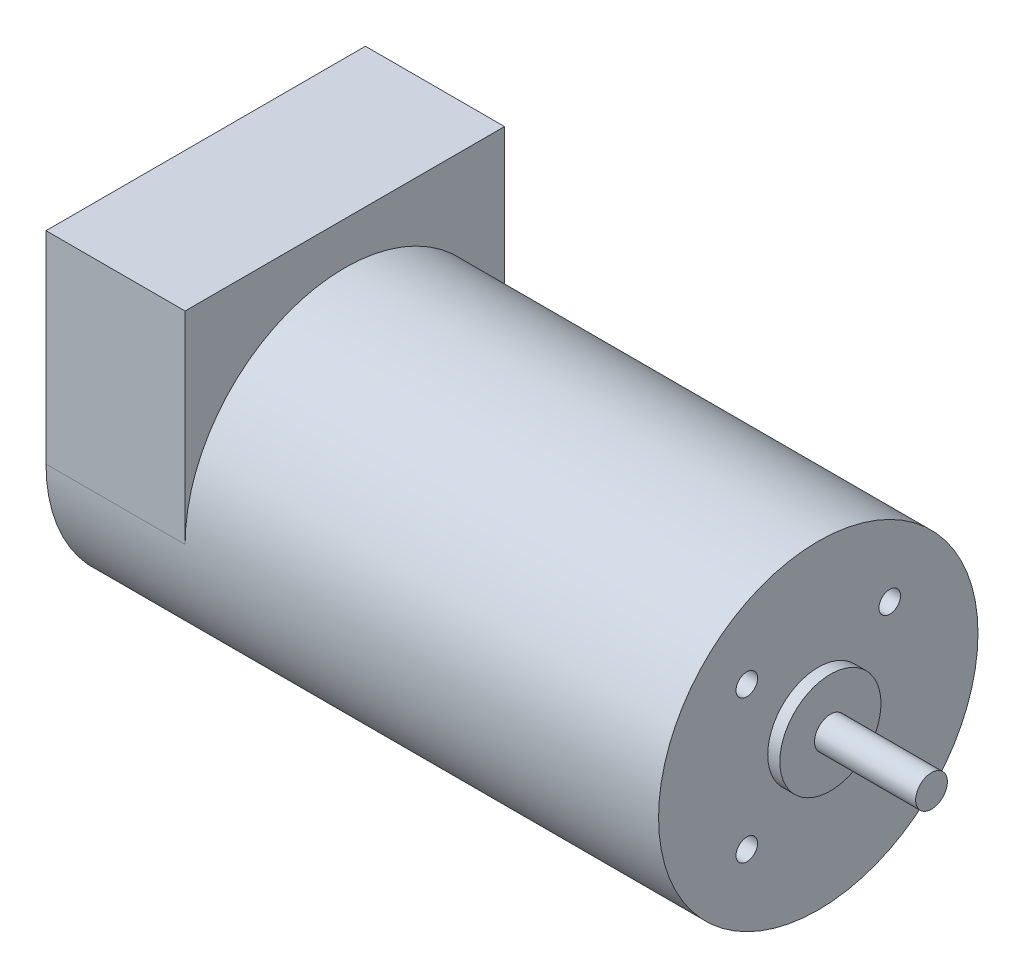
ISO-10303-21;
HEADER;
FILE_DESCRIPTION(('STEP AP214'),'2;1');
FILE_NAME('part.step','',(''),(''),'','','');
FILE_SCHEMA(('AUTOMOTIVE_DESIGN { 1 0 10303 214 1 1 1 1 }'));
ENDSEC;
DATA;
#1=APPLICATION_CONTEXT('core data for automotive mechanical design processes');
#2=APPLICATION_PROTOCOL_DEFINITION('international standard','automotive_design',2000,#1);
#3=PRODUCT_CONTEXT('',#1,'mechanical');
#4=PRODUCT('Part','Part','',(#3));
#5=PRODUCT_RELATED_PRODUCT_CATEGORY('part','',(#4));
#6=PRODUCT_DEFINITION_FORMATION('','',#4);
#7=PRODUCT_DEFINITION_CONTEXT('part definition',#1,'design');
#8=PRODUCT_DEFINITION('design','',#6,#7);
#9=PRODUCT_DEFINITION_SHAPE('','',#8);
#10=(LENGTH_UNIT() NAMED_UNIT(*) SI_UNIT(.MILLI.,.METRE.));
#11=(NAMED_UNIT(*) PLANE_ANGLE_UNIT() SI_UNIT($,.RADIAN.));
#12=(NAMED_UNIT(*) SI_UNIT($,.STERADIAN.) SOLID_ANGLE_UNIT());
#13=UNCERTAINTY_MEASURE_WITH_UNIT(LENGTH_MEASURE(1.E-05),#10,'distance_accuracy_value','');
#14=(GEOMETRIC_REPRESENTATION_CONTEXT(3) GLOBAL_UNCERTAINTY_ASSIGNED_CONTEXT((#13)) GLOBAL_UNIT_ASSIGNED_CONTEXT((#10,
#11,#12)) REPRESENTATION_CONTEXT('',''));
#15=CARTESIAN_POINT('',(0.,0.,0.));
#16=DIRECTION('',(0.,0.,1.));
#17=DIRECTION('',(1.,0.,0.));
#18=AXIS2_PLACEMENT_3D('',#15,#16,#17);
#19=CARTESIAN_POINT('',(78.486,0.,0.));
#20=DIRECTION('',(1.,0.,0.));
#21=DIRECTION('',(0.,0.,-1.));
#22=AXIS2_PLACEMENT_3D('',#19,#20,#21);
#23=PLANE('',#22);
#24=CARTESIAN_POINT('',(78.486,0.,0.));
#25=DIRECTION('',(1.,0.,0.));
#26=DIRECTION('',(0.,0.,-1.));
#27=AXIS2_PLACEMENT_3D('',#24,#25,#26);
#28=CIRCLE('',#27,6.35);
#29=CARTESIAN_POINT('',(78.486,0.,6.35));
#30=VERTEX_POINT('',#29);
#31=EDGE_CURVE('E139',#30,#30,#28,.T.);
#32=ORIENTED_EDGE('',*,*,#31,.T.);
#33=EDGE_LOOP('',(#32));
#34=FACE_BOUND('',#33,.T.);
#35=CARTESIAN_POINT('',(78.486,0.,0.));
#36=DIRECTION('',(1.,0.,0.));
#37=DIRECTION('',(0.,0.,-1.));
#38=AXIS2_PLACEMENT_3D('',#35,#36,#37);
#39=CIRCLE('',#38,1.9939);
#40=CARTESIAN_POINT('',(78.486,0.,-1.9939));
#41=VERTEX_POINT('',#40);
#42=EDGE_CURVE('E132',#41,#41,#39,.T.);
#43=ORIENTED_EDGE('',*,*,#42,.F.);
#44=EDGE_LOOP('',(#43));
#45=FACE_BOUND('',#44,.T.);
#46=ADVANCED_FACE('F36',(#34,#45),#23,.T.);
#47=CARTESIAN_POINT('',(76.962,0.,0.));
#48=DIRECTION('',(1.,0.,0.));
#49=DIRECTION('',(0.,0.,-1.));
#50=AXIS2_PLACEMENT_3D('',#47,#48,#49);
#51=PLANE('',#50);
#52=CARTESIAN_POINT('',(76.962,8.98025612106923,-8.98025612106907));
#53=DIRECTION('',(1.,0.,0.));
#54=DIRECTION('',(0.,0.,-1.));
#55=AXIS2_PLACEMENT_3D('',#52,#53,#54);
#56=CIRCLE('',#55,1.35255);
#57=CARTESIAN_POINT('',(76.962,8.98025612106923,-10.3328061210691));
#58=VERTEX_POINT('',#57);
#59=EDGE_CURVE('E110',#58,#58,#56,.T.);
#60=ORIENTED_EDGE('',*,*,#59,.F.);
#61=EDGE_LOOP('',(#60));
#62=FACE_BOUND('',#61,.T.);
#63=CARTESIAN_POINT('',(76.962,-8.98025612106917,-8.98025612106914));
#64=DIRECTION('',(1.,0.,0.));
#65=DIRECTION('',(0.,0.,-1.));
#66=AXIS2_PLACEMENT_3D('',#63,#64,#65);
#67=CIRCLE('',#66,1.35255);
#68=CARTESIAN_POINT('',(76.962,-8.98025612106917,-10.3328061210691));
#69=VERTEX_POINT('',#68);
#70=EDGE_CURVE('E109',#69,#69,#67,.T.);
#71=ORIENTED_EDGE('',*,*,#70,.F.);
#72=EDGE_LOOP('',(#71));
#73=FACE_BOUND('',#72,.T.);
#74=CARTESIAN_POINT('',(76.962,-8.98025612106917,8.98025612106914));
#75=DIRECTION('',(1.,0.,0.));
#76=DIRECTION('',(0.,0.,-1.));
#77=AXIS2_PLACEMENT_3D('',#74,#75,#76);
#78=CIRCLE('',#77,1.35255);
#79=CARTESIAN_POINT('',(76.962,-8.98025612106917,7.62770612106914));
#80=VERTEX_POINT('',#79);
#81=EDGE_CURVE('E120',#80,#80,#78,.T.);
#82=ORIENTED_EDGE('',*,*,#81,.F.);
#83=EDGE_LOOP('',(#82));
#84=FACE_BOUND('',#83,.T.);
#85=CARTESIAN_POINT('',(76.962,8.98025612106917,8.98025612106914));
#86=DIRECTION('',(1.,0.,0.));
#87=DIRECTION('',(0.,0.,-1.));
#88=AXIS2_PLACEMENT_3D('',#85,#86,#87);
#89=CIRCLE('',#88,1.35255);
#90=CARTESIAN_POINT('',(76.962,8.98025612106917,7.62770612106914));
#91=VERTEX_POINT('',#90);
#92=EDGE_CURVE('E126',#91,#91,#89,.T.);
#93=ORIENTED_EDGE('',*,*,#92,.F.);
#94=EDGE_LOOP('',(#93));
#95=FACE_BOUND('',#94,.T.);
#96=CARTESIAN_POINT('',(76.962,0.,0.));
#97=DIRECTION('',(1.,0.,0.));
#98=DIRECTION('',(0.,0.,-1.));
#99=AXIS2_PLACEMENT_3D('',#96,#97,#98);
#100=CIRCLE('',#99,20.066);
#101=CARTESIAN_POINT('',(76.962,0.,-20.066));
#102=VERTEX_POINT('',#101);
#103=EDGE_CURVE('E145',#102,#102,#100,.T.);
#104=ORIENTED_EDGE('',*,*,#103,.T.);
#105=EDGE_LOOP('',(#104));
#106=FACE_BOUND('',#105,.T.);
#107=CARTESIAN_POINT('',(76.962,0.,0.));
#108=DIRECTION('',(1.,0.,0.));
#109=DIRECTION('',(0.,0.,-1.));
#110=AXIS2_PLACEMENT_3D('',#107,#108,#109);
#111=CIRCLE('',#110,6.35);
#112=CARTESIAN_POINT('',(76.962,0.,6.35));
#113=VERTEX_POINT('',#112);
#114=EDGE_CURVE('E136',#113,#113,#111,.T.);
#115=ORIENTED_EDGE('',*,*,#114,.F.);
#116=EDGE_LOOP('',(#115));
#117=FACE_BOUND('',#116,.T.);
#118=ADVANCED_FACE('F182',(#62,#73,#84,#95,#106,#117),#51,.T.);
#119=CARTESIAN_POINT('',(17.4752,0.,0.));
#120=DIRECTION('',(-1.,0.,0.));
#121=DIRECTION('',(0.,0.,1.));
#122=AXIS2_PLACEMENT_3D('',#119,#120,#121);
#123=PLANE('',#122);
#124=CARTESIAN_POINT('',(17.4752,0.,0.));
#125=DIRECTION('',(1.,0.,0.));
#126=DIRECTION('',(0.,0.,-1.));
#127=AXIS2_PLACEMENT_3D('',#124,#125,#126);
#128=CIRCLE('',#127,20.066);
#129=CARTESIAN_POINT('',(17.4752,0.,-20.066));
#130=VERTEX_POINT('',#129);
#131=CARTESIAN_POINT('',(17.4752,0.,20.066));
#132=VERTEX_POINT('',#131);
#133=EDGE_CURVE('E142',#130,#132,#128,.T.);
#134=ORIENTED_EDGE('',*,*,#133,.F.);
#135=DIRECTION('',(0.,1.,0.));
#136=VECTOR('',#135,1.);
#137=CARTESIAN_POINT('',(17.4752,0.,-20.066));
#138=LINE('',#137,#136);
#139=CARTESIAN_POINT('',(17.4752,25.4,-20.066));
#140=VERTEX_POINT('',#139);
#141=EDGE_CURVE('E82',#130,#140,#138,.T.);
#142=ORIENTED_EDGE('',*,*,#141,.T.);
#143=DIRECTION('',(0.,0.,1.));
#144=VECTOR('',#143,1.);
#145=CARTESIAN_POINT('',(17.4752,25.4,-20.066));
#146=LINE('',#145,#144);
#147=CARTESIAN_POINT('',(17.4752,25.4,20.066));
#148=VERTEX_POINT('',#147);
#149=EDGE_CURVE('E152',#140,#148,#146,.T.);
#150=ORIENTED_EDGE('',*,*,#149,.T.);
#151=DIRECTION('',(0.,-1.,0.));
#152=VECTOR('',#151,1.);
#153=CARTESIAN_POINT('',(17.4752,25.4,20.066));
#154=LINE('',#153,#152);
#155=EDGE_CURVE('E55',#148,#132,#154,.T.);
#156=ORIENTED_EDGE('',*,*,#155,.T.);
#157=EDGE_LOOP('',(#134,#142,#150,#156));
#158=FACE_BOUND('',#157,.T.);
#159=ADVANCED_FACE('F180',(#158),#123,.F.);
#160=CARTESIAN_POINT('',(17.4752,0.,0.));
#161=DIRECTION('',(-1.,0.,0.));
#162=DIRECTION('',(0.,0.,1.));
#163=AXIS2_PLACEMENT_3D('',#160,#161,#162);
#164=CYLINDRICAL_SURFACE('',#163,20.066);
#165=CARTESIAN_POINT('',(0.,0.,0.));
#166=DIRECTION('',(1.,0.,0.));
#167=DIRECTION('',(0.,0.,1.));
#168=AXIS2_PLACEMENT_3D('',#165,#166,#167);
#169=CIRCLE('',#168,20.066);
#170=CARTESIAN_POINT('',(0.,0.,20.066));
#171=VERTEX_POINT('',#170);
#172=CARTESIAN_POINT('',(0.,0.,-20.066));
#173=VERTEX_POINT('',#172);
#174=EDGE_CURVE('E148',#171,#173,#169,.T.);
#175=ORIENTED_EDGE('',*,*,#174,.T.);
#176=DIRECTION('',(-1.,0.,0.));
#177=VECTOR('',#176,1.);
#178=CARTESIAN_POINT('',(17.4752,0.,-20.066));
#179=LINE('',#178,#177);
#180=EDGE_CURVE('E11',#130,#173,#179,.T.);
#181=ORIENTED_EDGE('',*,*,#180,.F.);
#182=ORIENTED_EDGE('',*,*,#133,.T.);
#183=DIRECTION('',(-1.,0.,0.));
#184=VECTOR('',#183,1.);
#185=CARTESIAN_POINT('',(17.4752,0.,20.066));
#186=LINE('',#185,#184);
#187=EDGE_CURVE('E164',#132,#171,#186,.T.);
#188=ORIENTED_EDGE('',*,*,#187,.T.);
#189=EDGE_LOOP('',(#175,#181,#182,#188));
#190=FACE_BOUND('',#189,.T.);
#191=ORIENTED_EDGE('',*,*,#103,.F.);
#192=EDGE_LOOP('',(#191));
#193=FACE_BOUND('',#192,.T.);
#194=ADVANCED_FACE('F38',(#190,#193),#164,.T.);
#195=CARTESIAN_POINT('',(17.4752,0.,-20.066));
#196=DIRECTION('',(0.,0.,1.));
#197=DIRECTION('',(1.,0.,0.));
#198=AXIS2_PLACEMENT_3D('',#195,#196,#197);
#199=PLANE('',#198);
#200=DIRECTION('',(0.,1.,0.));
#201=VECTOR('',#200,1.);
#202=CARTESIAN_POINT('',(0.,0.,-20.066));
#203=LINE('',#202,#201);
#204=CARTESIAN_POINT('',(0.,25.4,-20.066));
#205=VERTEX_POINT('',#204);
#206=EDGE_CURVE('E173',#173,#205,#203,.T.);
#207=ORIENTED_EDGE('',*,*,#206,.T.);
#208=DIRECTION('',(-1.,0.,0.));
#209=VECTOR('',#208,1.);
#210=CARTESIAN_POINT('',(17.4752,25.4,-20.066));
#211=LINE('',#210,#209);
#212=EDGE_CURVE('E46',#140,#205,#211,.T.);
#213=ORIENTED_EDGE('',*,*,#212,.F.);
#214=ORIENTED_EDGE('',*,*,#141,.F.);
#215=ORIENTED_EDGE('',*,*,#180,.T.);
#216=EDGE_LOOP('',(#207,#213,#214,#215));
#217=FACE_BOUND('',#216,.T.);
#218=ADVANCED_FACE('F178',(#217),#199,.F.);
#219=CARTESIAN_POINT('',(17.4752,25.4,-20.066));
#220=DIRECTION('',(0.,-1.,0.));
#221=DIRECTION('',(0.,0.,-1.));
#222=AXIS2_PLACEMENT_3D('',#219,#220,#221);
#223=PLANE('',#222);
#224=DIRECTION('',(0.,0.,1.));
#225=VECTOR('',#224,1.);
#226=CARTESIAN_POINT('',(0.,25.4,-20.066));
#227=LINE('',#226,#225);
#228=CARTESIAN_POINT('',(0.,25.4,20.066));
#229=VERTEX_POINT('',#228);
#230=EDGE_CURVE('E73',#205,#229,#227,.T.);
#231=ORIENTED_EDGE('',*,*,#230,.T.);
#232=DIRECTION('',(-1.,0.,0.));
#233=VECTOR('',#232,1.);
#234=CARTESIAN_POINT('',(17.4752,25.4,20.066));
#235=LINE('',#234,#233);
#236=EDGE_CURVE('E166',#148,#229,#235,.T.);
#237=ORIENTED_EDGE('',*,*,#236,.F.);
#238=ORIENTED_EDGE('',*,*,#149,.F.);
#239=ORIENTED_EDGE('',*,*,#212,.T.);
#240=EDGE_LOOP('',(#231,#237,#238,#239));
#241=FACE_BOUND('',#240,.T.);
#242=ADVANCED_FACE('F218',(#241),#223,.F.);
#243=CARTESIAN_POINT('',(17.4752,25.4,20.066));
#244=DIRECTION('',(0.,0.,-1.));
#245=DIRECTION('',(0.,1.,0.));
#246=AXIS2_PLACEMENT_3D('',#243,#244,#245);
#247=PLANE('',#246);
#248=DIRECTION('',(0.,-1.,0.));
#249=VECTOR('',#248,1.);
#250=CARTESIAN_POINT('',(0.,25.4,20.066));
#251=LINE('',#250,#249);
#252=EDGE_CURVE('E78',#229,#171,#251,.T.);
#253=ORIENTED_EDGE('',*,*,#252,.T.);
#254=ORIENTED_EDGE('',*,*,#187,.F.);
#255=ORIENTED_EDGE('',*,*,#155,.F.);
#256=ORIENTED_EDGE('',*,*,#236,.T.);
#257=EDGE_LOOP('',(#253,#254,#255,#256));
#258=FACE_BOUND('',#257,.T.);
#259=ADVANCED_FACE('F210',(#258),#247,.F.);
#260=CARTESIAN_POINT('',(0.,0.,0.));
#261=DIRECTION('',(-1.,0.,0.));
#262=DIRECTION('',(0.,0.,1.));
#263=AXIS2_PLACEMENT_3D('',#260,#261,#262);
#264=PLANE('',#263);
#265=ORIENTED_EDGE('',*,*,#174,.F.);
#266=ORIENTED_EDGE('',*,*,#252,.F.);
#267=ORIENTED_EDGE('',*,*,#230,.F.);
#268=ORIENTED_EDGE('',*,*,#206,.F.);
#269=EDGE_LOOP('',(#265,#266,#267,#268));
#270=FACE_BOUND('',#269,.T.);
#271=ADVANCED_FACE('F176',(#270),#264,.T.);
#272=CARTESIAN_POINT('',(78.486,0.,0.));
#273=DIRECTION('',(-1.,0.,0.));
#274=DIRECTION('',(0.,0.,1.));
#275=AXIS2_PLACEMENT_3D('',#272,#273,#274);
#276=CYLINDRICAL_SURFACE('',#275,6.35);
#277=CARTESIAN_POINT('',(78.486,0.,6.35));
#278=CARTESIAN_POINT('',(78.470125,0.,6.35));
#279=CARTESIAN_POINT('',(78.45425,0.,6.35));
#280=CARTESIAN_POINT('',(78.4225,0.,6.35));
#281=CARTESIAN_POINT('',(78.406625,0.,6.35));
#282=CARTESIAN_POINT('',(78.374875,0.,6.35));
#283=CARTESIAN_POINT('',(78.359,0.,6.35));
#284=CARTESIAN_POINT('',(78.32725,0.,6.35));
#285=CARTESIAN_POINT('',(78.311375,0.,6.35));
#286=CARTESIAN_POINT('',(78.279625,0.,6.35));
#287=CARTESIAN_POINT('',(78.26375,0.,6.35));
#288=CARTESIAN_POINT('',(78.232,0.,6.35));
#289=CARTESIAN_POINT('',(78.216125,0.,6.35));
#290=CARTESIAN_POINT('',(78.184375,0.,6.35));
#291=CARTESIAN_POINT('',(78.1685,0.,6.35));
#292=CARTESIAN_POINT('',(78.13675,0.,6.35));
#293=CARTESIAN_POINT('',(78.120875,0.,6.35));
#294=CARTESIAN_POINT('',(78.089125,0.,6.35));
#295=CARTESIAN_POINT('',(78.07325,0.,6.35));
#296=CARTESIAN_POINT('',(78.0415,0.,6.35));
#297=CARTESIAN_POINT('',(78.025625,0.,6.35));
#298=CARTESIAN_POINT('',(77.993875,0.,6.35));
#299=CARTESIAN_POINT('',(77.978,0.,6.35));
#300=CARTESIAN_POINT('',(77.94625,0.,6.35));
#301=CARTESIAN_POINT('',(77.930375,0.,6.35));
#302=CARTESIAN_POINT('',(77.898625,0.,6.35));
#303=CARTESIAN_POINT('',(77.88275,0.,6.35));
#304=CARTESIAN_POINT('',(77.851,0.,6.35));
#305=CARTESIAN_POINT('',(77.835125,0.,6.35));
#306=CARTESIAN_POINT('',(77.803375,0.,6.35));
#307=CARTESIAN_POINT('',(77.7875,0.,6.35));
#308=CARTESIAN_POINT('',(77.75575,0.,6.35));
#309=CARTESIAN_POINT('',(77.739875,0.,6.35));
#310=CARTESIAN_POINT('',(77.708125,0.,6.35));
#311=CARTESIAN_POINT('',(77.69225,0.,6.35));
#312=CARTESIAN_POINT('',(77.6605,0.,6.35));
#313=CARTESIAN_POINT('',(77.644625,0.,6.35));
#314=CARTESIAN_POINT('',(77.612875,0.,6.35));
#315=CARTESIAN_POINT('',(77.597,0.,6.35));
#316=CARTESIAN_POINT('',(77.56525,0.,6.35));
#317=CARTESIAN_POINT('',(77.549375,0.,6.35));
#318=CARTESIAN_POINT('',(77.517625,0.,6.35));
#319=CARTESIAN_POINT('',(77.50175,0.,6.35));
#320=CARTESIAN_POINT('',(77.47,0.,6.35));
#321=CARTESIAN_POINT('',(77.454125,0.,6.35));
#322=CARTESIAN_POINT('',(77.422375,0.,6.35));
#323=CARTESIAN_POINT('',(77.4065,0.,6.35));
#324=CARTESIAN_POINT('',(77.37475,0.,6.35));
#325=CARTESIAN_POINT('',(77.358875,0.,6.35));
#326=CARTESIAN_POINT('',(77.327125,0.,6.35));
#327=CARTESIAN_POINT('',(77.31125,0.,6.35));
#328=CARTESIAN_POINT('',(77.2795,0.,6.35));
#329=CARTESIAN_POINT('',(77.263625,0.,6.35));
#330=CARTESIAN_POINT('',(77.231875,0.,6.35));
#331=CARTESIAN_POINT('',(77.216,0.,6.35));
#332=CARTESIAN_POINT('',(77.18425,0.,6.35));
#333=CARTESIAN_POINT('',(77.168375,0.,6.35));
#334=CARTESIAN_POINT('',(77.136625,0.,6.35));
#335=CARTESIAN_POINT('',(77.12075,0.,6.35));
#336=CARTESIAN_POINT('',(77.089,0.,6.35));
#337=CARTESIAN_POINT('',(77.073125,0.,6.35));
#338=CARTESIAN_POINT('',(77.041375,0.,6.35));
#339=CARTESIAN_POINT('',(77.0255,0.,6.35));
#340=CARTESIAN_POINT('',(76.99375,0.,6.35));
#341=CARTESIAN_POINT('',(76.977875,0.,6.35));
#342=CARTESIAN_POINT('',(76.962,0.,6.35));
#343=B_SPLINE_CURVE_WITH_KNOTS('',3,(#277,#278,#279,#280,#281,#282,#283,#284,#285,#286,#287,
#288,#289,#290,#291,#292,#293,#294,#295,#296,#297,#298,#299,#300,#301,#302,#303,#304,#305,#306,
#307,#308,#309,#310,#311,#312,#313,#314,#315,#316,#317,#318,#319,#320,#321,#322,#323,#324,#325,
#326,#327,#328,#329,#330,#331,#332,#333,#334,#335,#336,#337,#338,#339,#340,#341,#342),
.UNSPECIFIED.,.F.,.F.,(4,2,2,2,2,2,2,2,2,2,2,2,2,2,2,2,2,2,2,2,2,2,2,2,2,2,2,2,2,2,2,2,4),(0.,
0.0476249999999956,0.0952499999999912,0.142874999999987,0.190499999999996,0.238124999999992,
0.285749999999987,0.333374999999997,0.380999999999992,0.428624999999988,0.476249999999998,
0.523874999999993,0.571499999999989,0.619124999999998,0.666749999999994,0.714374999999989,
0.761999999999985,0.809624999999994,0.85724999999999,0.904874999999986,0.952499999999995,
1.00012499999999,1.04774999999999,1.095375,1.14299999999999,1.19062499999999,1.23825,
1.28587499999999,1.33349999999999,1.381125,1.42874999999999,1.47637499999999,1.52399999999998),.UNSPECIFIED.);
#344=EDGE_CURVE('BSEAM201',#30,#113,#343,.T.);
#345=ORIENTED_EDGE('',*,*,#31,.F.);
#346=ORIENTED_EDGE('',*,*,#114,.T.);
#347=ORIENTED_EDGE('',*,*,#344,.T.);
#348=ORIENTED_EDGE('',*,*,#344,.F.);
#349=EDGE_LOOP('',(#345,#347,#346,#348));
#350=FACE_BOUND('',#349,.T.);
#351=ADVANCED_FACE('F201',(#350),#276,.T.);
#352=CARTESIAN_POINT('',(91.186,0.,0.));
#353=DIRECTION('',(-1.,0.,0.));
#354=DIRECTION('',(0.,0.,1.));
#355=AXIS2_PLACEMENT_3D('',#352,#353,#354);
#356=CYLINDRICAL_SURFACE('',#355,1.9939);
#357=CARTESIAN_POINT('',(91.186,0.,0.));
#358=DIRECTION('',(1.,0.,0.));
#359=DIRECTION('',(0.,0.,-1.));
#360=AXIS2_PLACEMENT_3D('',#357,#358,#359);
#361=CIRCLE('',#360,1.9939);
#362=CARTESIAN_POINT('',(91.186,0.,-1.9939));
#363=VERTEX_POINT('',#362);
#364=EDGE_CURVE('E133',#363,#363,#361,.T.);
#365=ORIENTED_EDGE('',*,*,#364,.F.);
#366=EDGE_LOOP('',(#365));
#367=FACE_BOUND('',#366,.T.);
#368=ORIENTED_EDGE('',*,*,#42,.T.);
#369=EDGE_LOOP('',(#368));
#370=FACE_BOUND('',#369,.T.);
#371=ADVANCED_FACE('F199',(#367,#370),#356,.T.);
#372=CARTESIAN_POINT('',(91.186,0.,0.));
#373=DIRECTION('',(1.,0.,0.));
#374=DIRECTION('',(0.,0.,-1.));
#375=AXIS2_PLACEMENT_3D('',#372,#373,#374);
#376=PLANE('',#375);
#377=ORIENTED_EDGE('',*,*,#364,.T.);
#378=EDGE_LOOP('',(#377));
#379=FACE_BOUND('',#378,.T.);
#380=ADVANCED_FACE('F208',(#379),#376,.T.);
#381=CARTESIAN_POINT('',(67.564,8.98025612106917,8.98025612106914));
#382=DIRECTION('',(1.,0.,0.));
#383=DIRECTION('',(0.,0.,-1.));
#384=AXIS2_PLACEMENT_3D('',#381,#382,#383);
#385=CONICAL_SURFACE('',#384,1.35255,1.02974425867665);
#386=CARTESIAN_POINT('',(66.7513059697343,8.98025612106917,8.98025612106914));
#387=VERTEX_POINT('',#386);
#388=VERTEX_LOOP('',#387);
#389=FACE_BOUND('',#388,.T.);
#390=CARTESIAN_POINT('',(67.564,8.98025612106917,8.98025612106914));
#391=DIRECTION('',(1.,0.,0.));
#392=DIRECTION('',(0.,0.,-1.));
#393=AXIS2_PLACEMENT_3D('',#390,#391,#392);
#394=CIRCLE('',#393,1.35255);
#395=CARTESIAN_POINT('',(67.564,8.98025612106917,7.62770612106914));
#396=VERTEX_POINT('',#395);
#397=EDGE_CURVE('E129',#396,#396,#394,.T.);
#398=ORIENTED_EDGE('',*,*,#397,.T.);
#399=EDGE_LOOP('',(#398));
#400=FACE_BOUND('',#399,.T.);
#401=ADVANCED_FACE('F260',(#389,#400),#385,.F.);
#402=CARTESIAN_POINT('',(76.962,8.98025612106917,8.98025612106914));
#403=DIRECTION('',(1.,0.,0.));
#404=DIRECTION('',(0.,0.,-1.));
#405=AXIS2_PLACEMENT_3D('',#402,#403,#404);
#406=CYLINDRICAL_SURFACE('',#405,1.35255);
#407=ORIENTED_EDGE('',*,*,#397,.F.);
#408=EDGE_LOOP('',(#407));
#409=FACE_BOUND('',#408,.T.);
#410=ORIENTED_EDGE('',*,*,#92,.T.);
#411=EDGE_LOOP('',(#410));
#412=FACE_BOUND('',#411,.T.);
#413=ADVANCED_FACE('F269',(#409,#412),#406,.F.);
#414=CARTESIAN_POINT('',(67.564,-8.98025612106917,8.98025612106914));
#415=DIRECTION('',(1.,0.,0.));
#416=DIRECTION('',(0.,0.,-1.));
#417=AXIS2_PLACEMENT_3D('',#414,#415,#416);
#418=CONICAL_SURFACE('',#417,1.35255,1.02974425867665);
#419=CARTESIAN_POINT('',(66.7513059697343,-8.98025612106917,8.98025612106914));
#420=VERTEX_POINT('',#419);
#421=VERTEX_LOOP('',#420);
#422=FACE_BOUND('',#421,.T.);
#423=CARTESIAN_POINT('',(67.564,-8.98025612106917,8.98025612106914));
#424=DIRECTION('',(1.,0.,0.));
#425=DIRECTION('',(0.,0.,-1.));
#426=AXIS2_PLACEMENT_3D('',#423,#424,#425);
#427=CIRCLE('',#426,1.35255);
#428=CARTESIAN_POINT('',(67.564,-8.98025612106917,7.62770612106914));
#429=VERTEX_POINT('',#428);
#430=EDGE_CURVE('E123',#429,#429,#427,.T.);
#431=ORIENTED_EDGE('',*,*,#430,.T.);
#432=EDGE_LOOP('',(#431));
#433=FACE_BOUND('',#432,.T.);
#434=ADVANCED_FACE('F280',(#422,#433),#418,.F.);
#435=CARTESIAN_POINT('',(76.962,-8.98025612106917,8.98025612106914));
#436=DIRECTION('',(1.,0.,0.));
#437=DIRECTION('',(0.,0.,-1.));
#438=AXIS2_PLACEMENT_3D('',#435,#436,#437);
#439=CYLINDRICAL_SURFACE('',#438,1.35255);
#440=ORIENTED_EDGE('',*,*,#430,.F.);
#441=EDGE_LOOP('',(#440));
#442=FACE_BOUND('',#441,.T.);
#443=ORIENTED_EDGE('',*,*,#81,.T.);
#444=EDGE_LOOP('',(#443));
#445=FACE_BOUND('',#444,.T.);
#446=ADVANCED_FACE('F298',(#442,#445),#439,.F.);
#447=CARTESIAN_POINT('',(67.564,-8.98025612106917,-8.98025612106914));
#448=DIRECTION('',(1.,0.,0.));
#449=DIRECTION('',(0.,0.,-1.));
#450=AXIS2_PLACEMENT_3D('',#447,#448,#449);
#451=CONICAL_SURFACE('',#450,1.35255,1.02974425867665);
#452=CARTESIAN_POINT('',(66.7513059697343,-8.98025612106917,-8.98025612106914));
#453=VERTEX_POINT('',#452);
#454=VERTEX_LOOP('',#453);
#455=FACE_BOUND('',#454,.T.);
#456=CARTESIAN_POINT('',(67.564,-8.98025612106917,-8.98025612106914));
#457=DIRECTION('',(1.,0.,0.));
#458=DIRECTION('',(0.,0.,-1.));
#459=AXIS2_PLACEMENT_3D('',#456,#457,#458);
#460=CIRCLE('',#459,1.35255);
#461=CARTESIAN_POINT('',(67.564,-8.98025612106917,-10.3328061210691));
#462=VERTEX_POINT('',#461);
#463=EDGE_CURVE('E113',#462,#462,#460,.T.);
#464=ORIENTED_EDGE('',*,*,#463,.T.);
#465=EDGE_LOOP('',(#464));
#466=FACE_BOUND('',#465,.T.);
#467=ADVANCED_FACE('F309',(#455,#466),#451,.F.);
#468=CARTESIAN_POINT('',(76.962,-8.98025612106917,-8.98025612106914));
#469=DIRECTION('',(1.,0.,0.));
#470=DIRECTION('',(0.,0.,-1.));
#471=AXIS2_PLACEMENT_3D('',#468,#469,#470);
#472=CYLINDRICAL_SURFACE('',#471,1.35255);
#473=ORIENTED_EDGE('',*,*,#463,.F.);
#474=EDGE_LOOP('',(#473));
#475=FACE_BOUND('',#474,.T.);
#476=ORIENTED_EDGE('',*,*,#70,.T.);
#477=EDGE_LOOP('',(#476));
#478=FACE_BOUND('',#477,.T.);
#479=ADVANCED_FACE('F103',(#475,#478),#472,.F.);
#480=CARTESIAN_POINT('',(67.564,8.98025612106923,-8.98025612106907));
#481=DIRECTION('',(1.,0.,0.));
#482=DIRECTION('',(0.,0.,-1.));
#483=AXIS2_PLACEMENT_3D('',#480,#481,#482);
#484=CONICAL_SURFACE('',#483,1.35255,1.02974425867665);
#485=CARTESIAN_POINT('',(66.7513059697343,8.98025612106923,-8.98025612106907));
#486=VERTEX_POINT('',#485);
#487=VERTEX_LOOP('',#486);
#488=FACE_BOUND('',#487,.T.);
#489=CARTESIAN_POINT('',(67.564,8.98025612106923,-8.98025612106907));
#490=DIRECTION('',(1.,0.,0.));
#491=DIRECTION('',(0.,0.,-1.));
#492=AXIS2_PLACEMENT_3D('',#489,#490,#491);
#493=CIRCLE('',#492,1.35255);
#494=CARTESIAN_POINT('',(67.564,8.98025612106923,-10.3328061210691));
#495=VERTEX_POINT('',#494);
#496=EDGE_CURVE('E107',#495,#495,#493,.T.);
#497=ORIENTED_EDGE('',*,*,#496,.T.);
#498=EDGE_LOOP('',(#497));
#499=FACE_BOUND('',#498,.T.);
#500=ADVANCED_FACE('F99',(#488,#499),#484,.F.);
#501=CARTESIAN_POINT('',(76.962,8.98025612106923,-8.98025612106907));
#502=DIRECTION('',(1.,0.,0.));
#503=DIRECTION('',(0.,0.,-1.));
#504=AXIS2_PLACEMENT_3D('',#501,#502,#503);
#505=CYLINDRICAL_SURFACE('',#504,1.35255);
#506=ORIENTED_EDGE('',*,*,#496,.F.);
#507=EDGE_LOOP('',(#506));
#508=FACE_BOUND('',#507,.T.);
#509=ORIENTED_EDGE('',*,*,#59,.T.);
#510=EDGE_LOOP('',(#509));
#511=FACE_BOUND('',#510,.T.);
#512=ADVANCED_FACE('F102',(#508,#511),#505,.F.);
#513=CLOSED_SHELL('',(#46,#118,#159,#194,#218,#242,#259,#271,#351,#371,#380,#401,#413,#434,#446,
#467,#479,#500,#512));
#514=MANIFOLD_SOLID_BREP('B2',#513);
#515=ADVANCED_BREP_SHAPE_REPRESENTATION('',(#18,#514),#14);
#516=SHAPE_DEFINITION_REPRESENTATION(#9,#515);
ENDSEC;
END-ISO-10303-21;
